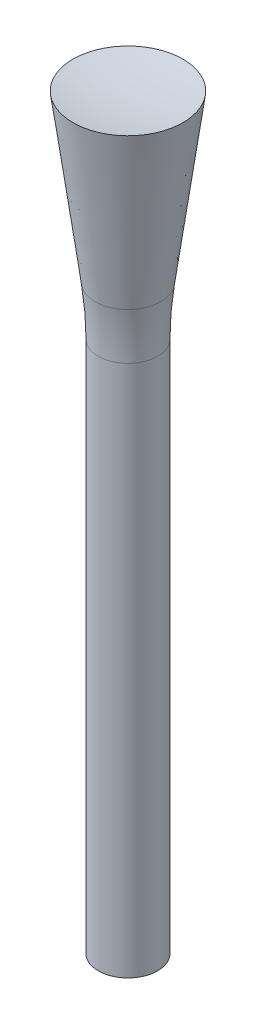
from build123d import *

# Parameters (mm, degrees)
FILLET1_R = 50


with BuildPart() as part:
    # Sketch2 → Revolve1 (revolve)
    with BuildSketch(Plane.XY):
        with BuildLine():
            Line((0, 0), (0, -100))
            Line((0, -100), (-4, -100))
            Line((-4, -100), (-4, -25))
            Line((-4, -25), (-7.409567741, 0.648253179))
            ThreePointArc((-7.409567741, 0.648253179), (-3.718935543, 0.162372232), (0, 0))
        make_face()
    revolve(axis=Axis((0, 0, 0), (0, -1, 0)))

    # Fillet1
    fillet1_edges = [part.edges().sort_by_distance(p)[0] for p in [
        (4, -25, 0),
    ]]
    fillet(fillet1_edges, radius=FILLET1_R)


solid = part.part
